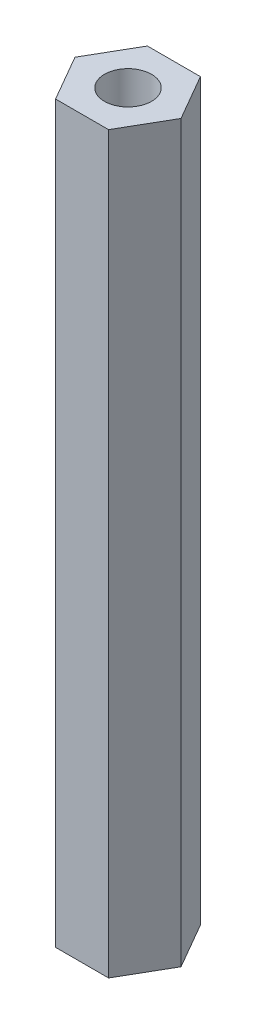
ISO-10303-21;
HEADER;
FILE_DESCRIPTION(('STEP AP214'),'2;1');
FILE_NAME('part.step','',(''),(''),'','','');
FILE_SCHEMA(('AUTOMOTIVE_DESIGN { 1 0 10303 214 1 1 1 1 }'));
ENDSEC;
DATA;
#1=APPLICATION_CONTEXT('core data for automotive mechanical design processes');
#2=APPLICATION_PROTOCOL_DEFINITION('international standard','automotive_design',2000,#1);
#3=PRODUCT_CONTEXT('',#1,'mechanical');
#4=PRODUCT('Part','Part','',(#3));
#5=PRODUCT_RELATED_PRODUCT_CATEGORY('part','',(#4));
#6=PRODUCT_DEFINITION_FORMATION('','',#4);
#7=PRODUCT_DEFINITION_CONTEXT('part definition',#1,'design');
#8=PRODUCT_DEFINITION('design','',#6,#7);
#9=PRODUCT_DEFINITION_SHAPE('','',#8);
#10=(LENGTH_UNIT() NAMED_UNIT(*) SI_UNIT(.MILLI.,.METRE.));
#11=(NAMED_UNIT(*) PLANE_ANGLE_UNIT() SI_UNIT($,.RADIAN.));
#12=(NAMED_UNIT(*) SI_UNIT($,.STERADIAN.) SOLID_ANGLE_UNIT());
#13=UNCERTAINTY_MEASURE_WITH_UNIT(LENGTH_MEASURE(1.E-05),#10,'distance_accuracy_value','');
#14=(GEOMETRIC_REPRESENTATION_CONTEXT(3) GLOBAL_UNCERTAINTY_ASSIGNED_CONTEXT((#13)) GLOBAL_UNIT_ASSIGNED_CONTEXT((#10,
#11,#12)) REPRESENTATION_CONTEXT('',''));
#15=CARTESIAN_POINT('',(0.,0.,0.));
#16=DIRECTION('',(0.,0.,1.));
#17=DIRECTION('',(1.,0.,0.));
#18=AXIS2_PLACEMENT_3D('',#15,#16,#17);
#19=CARTESIAN_POINT('',(0.,50.8,0.));
#20=DIRECTION('',(0.,1.,0.));
#21=DIRECTION('',(0.,0.,1.));
#22=AXIS2_PLACEMENT_3D('',#19,#20,#21);
#23=PLANE('',#22);
#24=DIRECTION('',(-0.500000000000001,0.,-0.866025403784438));
#25=VECTOR('',#24,1.);
#26=CARTESIAN_POINT('',(3.66617420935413,50.8,0.));
#27=LINE('',#26,#25);
#28=CARTESIAN_POINT('',(3.66617420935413,50.8,0.));
#29=VERTEX_POINT('',#28);
#30=CARTESIAN_POINT('',(1.83308710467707,50.8,-3.175));
#31=VERTEX_POINT('',#30);
#32=EDGE_CURVE('E128',#29,#31,#27,.T.);
#33=ORIENTED_EDGE('',*,*,#32,.T.);
#34=DIRECTION('',(-1.,0.,0.));
#35=VECTOR('',#34,1.);
#36=CARTESIAN_POINT('',(1.83308710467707,50.8,-3.175));
#37=LINE('',#36,#35);
#38=CARTESIAN_POINT('',(-1.83308710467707,50.8,-3.175));
#39=VERTEX_POINT('',#38);
#40=EDGE_CURVE('E86',#31,#39,#37,.T.);
#41=ORIENTED_EDGE('',*,*,#40,.T.);
#42=DIRECTION('',(-0.500000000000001,0.,0.866025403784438));
#43=VECTOR('',#42,1.);
#44=CARTESIAN_POINT('',(-1.83308710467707,50.8,-3.175));
#45=LINE('',#44,#43);
#46=CARTESIAN_POINT('',(-3.66617420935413,50.8,0.));
#47=VERTEX_POINT('',#46);
#48=EDGE_CURVE('E99',#39,#47,#45,.T.);
#49=ORIENTED_EDGE('',*,*,#48,.T.);
#50=DIRECTION('',(0.5,0.,0.866025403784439));
#51=VECTOR('',#50,1.);
#52=CARTESIAN_POINT('',(-3.66617420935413,50.8,0.));
#53=LINE('',#52,#51);
#54=CARTESIAN_POINT('',(-1.83308710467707,50.8,3.175));
#55=VERTEX_POINT('',#54);
#56=EDGE_CURVE('E93',#47,#55,#53,.T.);
#57=ORIENTED_EDGE('',*,*,#56,.T.);
#58=DIRECTION('',(1.,0.,0.));
#59=VECTOR('',#58,1.);
#60=CARTESIAN_POINT('',(-1.83308710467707,50.8,3.175));
#61=LINE('',#60,#59);
#62=CARTESIAN_POINT('',(1.83308710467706,50.8,3.175));
#63=VERTEX_POINT('',#62);
#64=EDGE_CURVE('E97',#55,#63,#61,.T.);
#65=ORIENTED_EDGE('',*,*,#64,.T.);
#66=DIRECTION('',(0.500000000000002,0.,-0.866025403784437));
#67=VECTOR('',#66,1.);
#68=CARTESIAN_POINT('',(1.83308710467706,50.8,3.175));
#69=LINE('',#68,#67);
#70=EDGE_CURVE('E49',#63,#29,#69,.T.);
#71=ORIENTED_EDGE('',*,*,#70,.T.);
#72=EDGE_LOOP('',(#33,#41,#49,#57,#65,#71));
#73=FACE_BOUND('',#72,.T.);
#74=CARTESIAN_POINT('',(0.,50.8,0.));
#75=DIRECTION('',(0.,1.,0.));
#76=DIRECTION('',(0.,0.,1.));
#77=AXIS2_PLACEMENT_3D('',#74,#75,#76);
#78=CIRCLE('',#77,1.6256);
#79=CARTESIAN_POINT('',(0.,50.8,1.6256));
#80=VERTEX_POINT('',#79);
#81=EDGE_CURVE('E121',#80,#80,#78,.T.);
#82=ORIENTED_EDGE('',*,*,#81,.F.);
#83=EDGE_LOOP('',(#82));
#84=FACE_BOUND('',#83,.T.);
#85=ADVANCED_FACE('F32',(#73,#84),#23,.T.);
#86=CARTESIAN_POINT('',(0.,0.,0.));
#87=DIRECTION('',(0.,1.,0.));
#88=DIRECTION('',(0.,0.,1.));
#89=AXIS2_PLACEMENT_3D('',#86,#87,#88);
#90=PLANE('',#89);
#91=DIRECTION('',(-0.500000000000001,0.,-0.866025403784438));
#92=VECTOR('',#91,1.);
#93=CARTESIAN_POINT('',(3.66617420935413,0.,0.));
#94=LINE('',#93,#92);
#95=CARTESIAN_POINT('',(3.66617420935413,0.,0.));
#96=VERTEX_POINT('',#95);
#97=CARTESIAN_POINT('',(1.83308710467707,0.,-3.175));
#98=VERTEX_POINT('',#97);
#99=EDGE_CURVE('E117',#96,#98,#94,.T.);
#100=ORIENTED_EDGE('',*,*,#99,.F.);
#101=DIRECTION('',(0.500000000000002,0.,-0.866025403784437));
#102=VECTOR('',#101,1.);
#103=CARTESIAN_POINT('',(1.83308710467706,0.,3.175));
#104=LINE('',#103,#102);
#105=CARTESIAN_POINT('',(1.83308710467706,0.,3.175));
#106=VERTEX_POINT('',#105);
#107=EDGE_CURVE('E78',#106,#96,#104,.T.);
#108=ORIENTED_EDGE('',*,*,#107,.F.);
#109=DIRECTION('',(1.,0.,0.));
#110=VECTOR('',#109,1.);
#111=CARTESIAN_POINT('',(-1.83308710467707,0.,3.175));
#112=LINE('',#111,#110);
#113=CARTESIAN_POINT('',(-1.83308710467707,0.,3.175));
#114=VERTEX_POINT('',#113);
#115=EDGE_CURVE('E72',#114,#106,#112,.T.);
#116=ORIENTED_EDGE('',*,*,#115,.F.);
#117=DIRECTION('',(0.5,0.,0.866025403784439));
#118=VECTOR('',#117,1.);
#119=CARTESIAN_POINT('',(-3.66617420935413,0.,0.));
#120=LINE('',#119,#118);
#121=CARTESIAN_POINT('',(-3.66617420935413,0.,0.));
#122=VERTEX_POINT('',#121);
#123=EDGE_CURVE('E107',#122,#114,#120,.T.);
#124=ORIENTED_EDGE('',*,*,#123,.F.);
#125=DIRECTION('',(-0.500000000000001,0.,0.866025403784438));
#126=VECTOR('',#125,1.);
#127=CARTESIAN_POINT('',(-1.83308710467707,0.,-3.175));
#128=LINE('',#127,#126);
#129=CARTESIAN_POINT('',(-1.83308710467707,0.,-3.175));
#130=VERTEX_POINT('',#129);
#131=EDGE_CURVE('E123',#130,#122,#128,.T.);
#132=ORIENTED_EDGE('',*,*,#131,.F.);
#133=DIRECTION('',(-1.,0.,0.));
#134=VECTOR('',#133,1.);
#135=CARTESIAN_POINT('',(1.83308710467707,0.,-3.175));
#136=LINE('',#135,#134);
#137=EDGE_CURVE('E120',#98,#130,#136,.T.);
#138=ORIENTED_EDGE('',*,*,#137,.F.);
#139=EDGE_LOOP('',(#100,#108,#116,#124,#132,#138));
#140=FACE_BOUND('',#139,.T.);
#141=CARTESIAN_POINT('',(0.,0.,0.));
#142=DIRECTION('',(0.,1.,0.));
#143=DIRECTION('',(0.,0.,1.));
#144=AXIS2_PLACEMENT_3D('',#141,#142,#143);
#145=CIRCLE('',#144,1.6256);
#146=CARTESIAN_POINT('',(0.,0.,1.6256));
#147=VERTEX_POINT('',#146);
#148=EDGE_CURVE('E221',#147,#147,#145,.T.);
#149=ORIENTED_EDGE('',*,*,#148,.T.);
#150=EDGE_LOOP('',(#149));
#151=FACE_BOUND('',#150,.T.);
#152=ADVANCED_FACE('F137',(#140,#151),#90,.F.);
#153=CARTESIAN_POINT('',(3.66617420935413,50.8,0.));
#154=DIRECTION('',(-0.866025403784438,0.,0.500000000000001));
#155=DIRECTION('',(0.500000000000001,0.,0.866025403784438));
#156=AXIS2_PLACEMENT_3D('',#153,#154,#155);
#157=PLANE('',#156);
#158=ORIENTED_EDGE('',*,*,#99,.T.);
#159=DIRECTION('',(0.,-1.,0.));
#160=VECTOR('',#159,1.);
#161=CARTESIAN_POINT('',(1.83308710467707,50.8,-3.175));
#162=LINE('',#161,#160);
#163=EDGE_CURVE('E11',#31,#98,#162,.T.);
#164=ORIENTED_EDGE('',*,*,#163,.F.);
#165=ORIENTED_EDGE('',*,*,#32,.F.);
#166=DIRECTION('',(0.,-1.,0.));
#167=VECTOR('',#166,1.);
#168=CARTESIAN_POINT('',(3.66617420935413,50.8,0.));
#169=LINE('',#168,#167);
#170=EDGE_CURVE('E113',#29,#96,#169,.T.);
#171=ORIENTED_EDGE('',*,*,#170,.T.);
#172=EDGE_LOOP('',(#158,#164,#165,#171));
#173=FACE_BOUND('',#172,.T.);
#174=ADVANCED_FACE('F34',(#173),#157,.F.);
#175=CARTESIAN_POINT('',(1.83308710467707,50.8,-3.175));
#176=DIRECTION('',(0.,0.,1.));
#177=DIRECTION('',(1.,0.,0.));
#178=AXIS2_PLACEMENT_3D('',#175,#176,#177);
#179=PLANE('',#178);
#180=ORIENTED_EDGE('',*,*,#137,.T.);
#181=DIRECTION('',(0.,-1.,0.));
#182=VECTOR('',#181,1.);
#183=CARTESIAN_POINT('',(-1.83308710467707,50.8,-3.175));
#184=LINE('',#183,#182);
#185=EDGE_CURVE('E41',#39,#130,#184,.T.);
#186=ORIENTED_EDGE('',*,*,#185,.F.);
#187=ORIENTED_EDGE('',*,*,#40,.F.);
#188=ORIENTED_EDGE('',*,*,#163,.T.);
#189=EDGE_LOOP('',(#180,#186,#187,#188));
#190=FACE_BOUND('',#189,.T.);
#191=ADVANCED_FACE('F162',(#190),#179,.F.);
#192=CARTESIAN_POINT('',(-1.83308710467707,50.8,-3.175));
#193=DIRECTION('',(0.866025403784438,0.,0.500000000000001));
#194=DIRECTION('',(0.500000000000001,0.,-0.866025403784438));
#195=AXIS2_PLACEMENT_3D('',#192,#193,#194);
#196=PLANE('',#195);
#197=ORIENTED_EDGE('',*,*,#131,.T.);
#198=DIRECTION('',(0.,-1.,0.));
#199=VECTOR('',#198,1.);
#200=CARTESIAN_POINT('',(-3.66617420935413,50.8,0.));
#201=LINE('',#200,#199);
#202=EDGE_CURVE('E108',#47,#122,#201,.T.);
#203=ORIENTED_EDGE('',*,*,#202,.F.);
#204=ORIENTED_EDGE('',*,*,#48,.F.);
#205=ORIENTED_EDGE('',*,*,#185,.T.);
#206=EDGE_LOOP('',(#197,#203,#204,#205));
#207=FACE_BOUND('',#206,.T.);
#208=ADVANCED_FACE('F134',(#207),#196,.F.);
#209=CARTESIAN_POINT('',(-3.66617420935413,50.8,0.));
#210=DIRECTION('',(0.866025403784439,0.,-0.5));
#211=DIRECTION('',(-0.5,0.,-0.866025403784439));
#212=AXIS2_PLACEMENT_3D('',#209,#210,#211);
#213=PLANE('',#212);
#214=ORIENTED_EDGE('',*,*,#123,.T.);
#215=DIRECTION('',(0.,-1.,0.));
#216=VECTOR('',#215,1.);
#217=CARTESIAN_POINT('',(-1.83308710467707,50.8,3.175));
#218=LINE('',#217,#216);
#219=EDGE_CURVE('E104',#55,#114,#218,.T.);
#220=ORIENTED_EDGE('',*,*,#219,.F.);
#221=ORIENTED_EDGE('',*,*,#56,.F.);
#222=ORIENTED_EDGE('',*,*,#202,.T.);
#223=EDGE_LOOP('',(#214,#220,#221,#222));
#224=FACE_BOUND('',#223,.T.);
#225=ADVANCED_FACE('F105',(#224),#213,.F.);
#226=CARTESIAN_POINT('',(-1.83308710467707,50.8,3.175));
#227=DIRECTION('',(0.,0.,-1.));
#228=DIRECTION('',(-1.,0.,0.));
#229=AXIS2_PLACEMENT_3D('',#226,#227,#228);
#230=PLANE('',#229);
#231=ORIENTED_EDGE('',*,*,#115,.T.);
#232=DIRECTION('',(0.,-1.,0.));
#233=VECTOR('',#232,1.);
#234=CARTESIAN_POINT('',(1.83308710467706,50.8,3.175));
#235=LINE('',#234,#233);
#236=EDGE_CURVE('E109',#63,#106,#235,.T.);
#237=ORIENTED_EDGE('',*,*,#236,.F.);
#238=ORIENTED_EDGE('',*,*,#64,.F.);
#239=ORIENTED_EDGE('',*,*,#219,.T.);
#240=EDGE_LOOP('',(#231,#237,#238,#239));
#241=FACE_BOUND('',#240,.T.);
#242=ADVANCED_FACE('F111',(#241),#230,.F.);
#243=CARTESIAN_POINT('',(1.83308710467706,50.8,3.175));
#244=DIRECTION('',(-0.866025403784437,0.,-0.500000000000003));
#245=DIRECTION('',(-0.500000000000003,0.,0.866025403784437));
#246=AXIS2_PLACEMENT_3D('',#243,#244,#245);
#247=PLANE('',#246);
#248=ORIENTED_EDGE('',*,*,#107,.T.);
#249=ORIENTED_EDGE('',*,*,#170,.F.);
#250=ORIENTED_EDGE('',*,*,#70,.F.);
#251=ORIENTED_EDGE('',*,*,#236,.T.);
#252=EDGE_LOOP('',(#248,#249,#250,#251));
#253=FACE_BOUND('',#252,.T.);
#254=ADVANCED_FACE('F142',(#253),#247,.F.);
#255=CARTESIAN_POINT('',(0.,50.8,0.));
#256=DIRECTION('',(0.,-1.,0.));
#257=DIRECTION('',(0.,0.,-1.));
#258=AXIS2_PLACEMENT_3D('',#255,#256,#257);
#259=CYLINDRICAL_SURFACE('',#258,1.6256);
#260=ORIENTED_EDGE('',*,*,#81,.T.);
#261=EDGE_LOOP('',(#260));
#262=FACE_BOUND('',#261,.T.);
#263=ORIENTED_EDGE('',*,*,#148,.F.);
#264=EDGE_LOOP('',(#263));
#265=FACE_BOUND('',#264,.T.);
#266=ADVANCED_FACE('F144',(#262,#265),#259,.F.);
#267=CLOSED_SHELL('',(#85,#152,#174,#191,#208,#225,#242,#254,#266));
#268=MANIFOLD_SOLID_BREP('B2',#267);
#269=ADVANCED_BREP_SHAPE_REPRESENTATION('',(#18,#268),#14);
#270=SHAPE_DEFINITION_REPRESENTATION(#9,#269);
ENDSEC;
END-ISO-10303-21;
